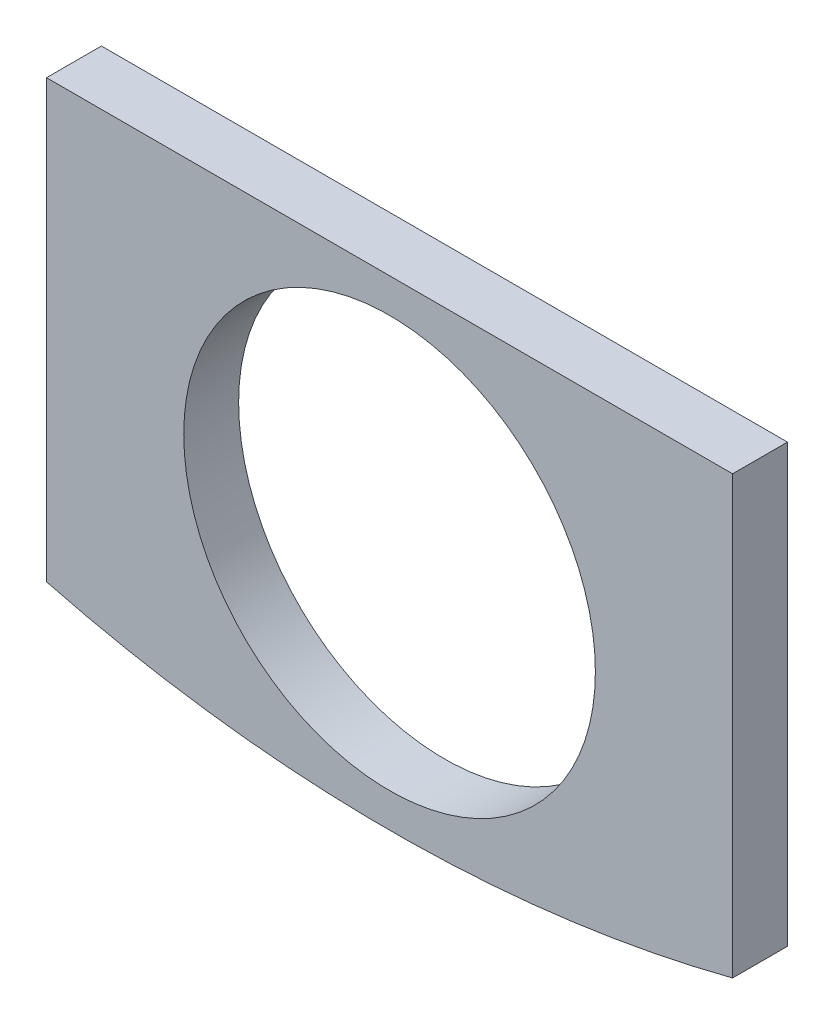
from build123d import *

# Parameters (mm, degrees)
BASE_EXTRUDE_DEPTH = 4
SKETCH3_R          = 15
CUT_EXTRUDE1_DEPTH = 44.197222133


with BuildPart() as part:
    # Sketch1 → Base-Extrude (new body)
    with BuildSketch(Plane.XY):
        with BuildLine():
            Line((-25, 3.175416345), (-25, 35))
            Line((-25, 35), (25, 35))
            Line((25, 35), (25, 3.175416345))
            ThreePointArc((25, 3.175416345), (0, 0), (-25, 3.175416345))
        make_face()
    extrude(amount=BASE_EXTRUDE_DEPTH)

    # Sketch3 → Cut-Extrude1 (cut, through all)
    with BuildSketch(Plane.XY.offset(4)):
        with Locations((0, 17.5)):
            Circle(SKETCH3_R)
    extrude(amount=-CUT_EXTRUDE1_DEPTH, mode=Mode.SUBTRACT)


solid = part.part
